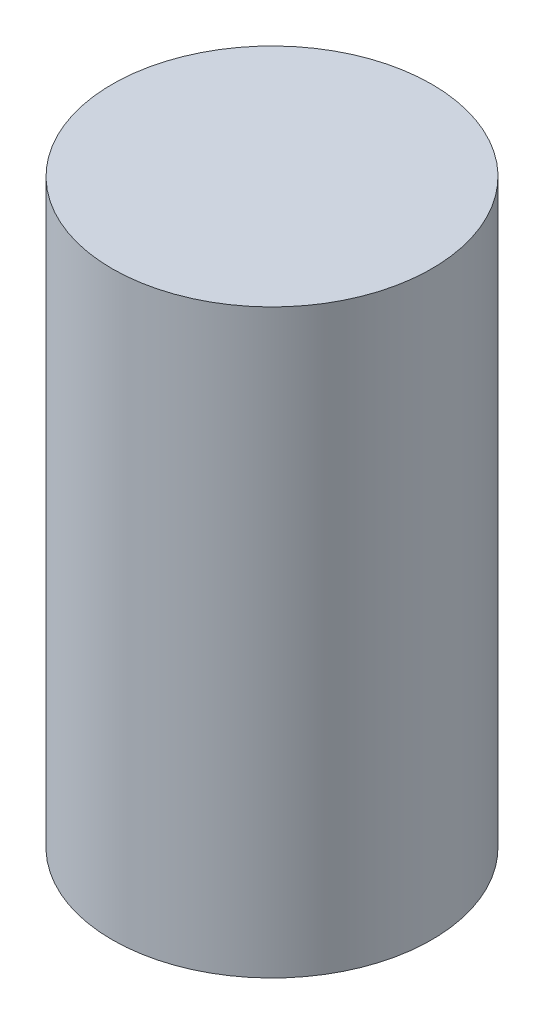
ISO-10303-21;
HEADER;
FILE_DESCRIPTION(('STEP AP214'),'2;1');
FILE_NAME('part.step','',(''),(''),'','','');
FILE_SCHEMA(('AUTOMOTIVE_DESIGN { 1 0 10303 214 1 1 1 1 }'));
ENDSEC;
DATA;
#1=APPLICATION_CONTEXT('core data for automotive mechanical design processes');
#2=APPLICATION_PROTOCOL_DEFINITION('international standard','automotive_design',2000,#1);
#3=PRODUCT_CONTEXT('',#1,'mechanical');
#4=PRODUCT('Part','Part','',(#3));
#5=PRODUCT_RELATED_PRODUCT_CATEGORY('part','',(#4));
#6=PRODUCT_DEFINITION_FORMATION('','',#4);
#7=PRODUCT_DEFINITION_CONTEXT('part definition',#1,'design');
#8=PRODUCT_DEFINITION('design','',#6,#7);
#9=PRODUCT_DEFINITION_SHAPE('','',#8);
#10=(LENGTH_UNIT() NAMED_UNIT(*) SI_UNIT(.MILLI.,.METRE.));
#11=(NAMED_UNIT(*) PLANE_ANGLE_UNIT() SI_UNIT($,.RADIAN.));
#12=(NAMED_UNIT(*) SI_UNIT($,.STERADIAN.) SOLID_ANGLE_UNIT());
#13=UNCERTAINTY_MEASURE_WITH_UNIT(LENGTH_MEASURE(1.E-05),#10,'distance_accuracy_value','');
#14=(GEOMETRIC_REPRESENTATION_CONTEXT(3) GLOBAL_UNCERTAINTY_ASSIGNED_CONTEXT((#13)) GLOBAL_UNIT_ASSIGNED_CONTEXT((#10,
#11,#12)) REPRESENTATION_CONTEXT('',''));
#15=CARTESIAN_POINT('',(0.,0.,0.));
#16=DIRECTION('',(0.,0.,1.));
#17=DIRECTION('',(1.,0.,0.));
#18=AXIS2_PLACEMENT_3D('',#15,#16,#17);
#19=CARTESIAN_POINT('',(0.,80.,0.));
#20=DIRECTION('',(0.,-1.,0.));
#21=DIRECTION('',(0.,0.,-1.));
#22=AXIS2_PLACEMENT_3D('',#19,#20,#21);
#23=CYLINDRICAL_SURFACE('',#22,22.);
#24=CARTESIAN_POINT('',(0.,80.,0.));
#25=DIRECTION('',(0.,1.,0.));
#26=DIRECTION('',(0.,0.,1.));
#27=AXIS2_PLACEMENT_3D('',#24,#25,#26);
#28=CIRCLE('',#27,22.);
#29=CARTESIAN_POINT('',(0.,80.,22.));
#30=VERTEX_POINT('',#29);
#31=EDGE_CURVE('E10',#30,#30,#28,.T.);
#32=ORIENTED_EDGE('',*,*,#31,.F.);
#33=EDGE_LOOP('',(#32));
#34=FACE_BOUND('',#33,.T.);
#35=CARTESIAN_POINT('',(0.,0.,0.));
#36=DIRECTION('',(0.,1.,0.));
#37=DIRECTION('',(0.,0.,1.));
#38=AXIS2_PLACEMENT_3D('',#35,#36,#37);
#39=CIRCLE('',#38,22.);
#40=CARTESIAN_POINT('',(0.,0.,22.));
#41=VERTEX_POINT('',#40);
#42=EDGE_CURVE('E42',#41,#41,#39,.T.);
#43=ORIENTED_EDGE('',*,*,#42,.T.);
#44=EDGE_LOOP('',(#43));
#45=FACE_BOUND('',#44,.T.);
#46=ADVANCED_FACE('F39',(#34,#45),#23,.T.);
#47=CARTESIAN_POINT('',(0.,80.,0.));
#48=DIRECTION('',(0.,1.,0.));
#49=DIRECTION('',(0.,0.,1.));
#50=AXIS2_PLACEMENT_3D('',#47,#48,#49);
#51=PLANE('',#50);
#52=ORIENTED_EDGE('',*,*,#31,.T.);
#53=EDGE_LOOP('',(#52));
#54=FACE_BOUND('',#53,.T.);
#55=ADVANCED_FACE('F54',(#54),#51,.T.);
#56=CARTESIAN_POINT('',(0.,0.,0.));
#57=DIRECTION('',(0.,1.,0.));
#58=DIRECTION('',(0.,0.,1.));
#59=AXIS2_PLACEMENT_3D('',#56,#57,#58);
#60=PLANE('',#59);
#61=ORIENTED_EDGE('',*,*,#42,.F.);
#62=EDGE_LOOP('',(#61));
#63=FACE_BOUND('',#62,.T.);
#64=ADVANCED_FACE('F52',(#63),#60,.F.);
#65=CLOSED_SHELL('',(#46,#55,#64));
#66=MANIFOLD_SOLID_BREP('B2',#65);
#67=ADVANCED_BREP_SHAPE_REPRESENTATION('',(#18,#66),#14);
#68=SHAPE_DEFINITION_REPRESENTATION(#9,#67);
ENDSEC;
END-ISO-10303-21;
